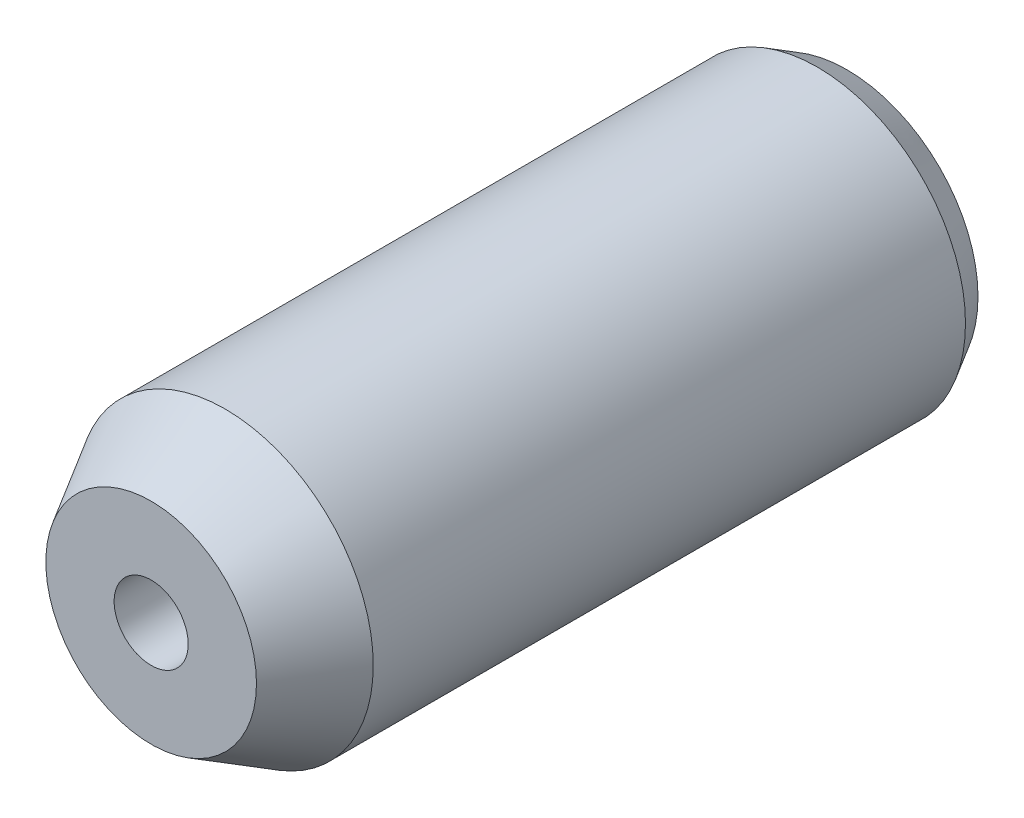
ISO-10303-21;
HEADER;
FILE_DESCRIPTION(('STEP AP214'),'2;1');
FILE_NAME('part.step','',(''),(''),'','','');
FILE_SCHEMA(('AUTOMOTIVE_DESIGN { 1 0 10303 214 1 1 1 1 }'));
ENDSEC;
DATA;
#1=APPLICATION_CONTEXT('core data for automotive mechanical design processes');
#2=APPLICATION_PROTOCOL_DEFINITION('international standard','automotive_design',2000,#1);
#3=PRODUCT_CONTEXT('',#1,'mechanical');
#4=PRODUCT('Part','Part','',(#3));
#5=PRODUCT_RELATED_PRODUCT_CATEGORY('part','',(#4));
#6=PRODUCT_DEFINITION_FORMATION('','',#4);
#7=PRODUCT_DEFINITION_CONTEXT('part definition',#1,'design');
#8=PRODUCT_DEFINITION('design','',#6,#7);
#9=PRODUCT_DEFINITION_SHAPE('','',#8);
#10=(LENGTH_UNIT() NAMED_UNIT(*) SI_UNIT(.MILLI.,.METRE.));
#11=(NAMED_UNIT(*) PLANE_ANGLE_UNIT() SI_UNIT($,.RADIAN.));
#12=(NAMED_UNIT(*) SI_UNIT($,.STERADIAN.) SOLID_ANGLE_UNIT());
#13=UNCERTAINTY_MEASURE_WITH_UNIT(LENGTH_MEASURE(1.E-05),#10,'distance_accuracy_value','');
#14=(GEOMETRIC_REPRESENTATION_CONTEXT(3) GLOBAL_UNCERTAINTY_ASSIGNED_CONTEXT((#13)) GLOBAL_UNIT_ASSIGNED_CONTEXT((#10,
#11,#12)) REPRESENTATION_CONTEXT('',''));
#15=CARTESIAN_POINT('',(0.,0.,0.));
#16=DIRECTION('',(0.,0.,1.));
#17=DIRECTION('',(1.,0.,0.));
#18=AXIS2_PLACEMENT_3D('',#15,#16,#17);
#19=CARTESIAN_POINT('',(0.,0.,0.));
#20=DIRECTION('',(0.,0.,1.));
#21=DIRECTION('',(1.,0.,0.));
#22=AXIS2_PLACEMENT_3D('',#19,#20,#21);
#23=PLANE('',#22);
#24=CARTESIAN_POINT('',(0.,0.,0.));
#25=DIRECTION('',(0.,0.,1.));
#26=DIRECTION('',(1.,0.,0.));
#27=AXIS2_PLACEMENT_3D('',#24,#25,#26);
#28=CIRCLE('',#27,8.84529946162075);
#29=CARTESIAN_POINT('',(8.84529946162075,0.,0.));
#30=VERTEX_POINT('',#29);
#31=EDGE_CURVE('E8',#30,#30,#28,.T.);
#32=ORIENTED_EDGE('',*,*,#31,.F.);
#33=EDGE_LOOP('',(#32));
#34=FACE_BOUND('',#33,.T.);
#35=ADVANCED_FACE('F12',(#34),#23,.F.);
#36=CARTESIAN_POINT('',(0.,0.,2.));
#37=DIRECTION('',(0.,0.,1.));
#38=DIRECTION('',(1.,0.,0.));
#39=AXIS2_PLACEMENT_3D('',#36,#37,#38);
#40=CONICAL_SURFACE('',#39,10.,0.523598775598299);
#41=ORIENTED_EDGE('',*,*,#31,.T.);
#42=EDGE_LOOP('',(#41));
#43=FACE_BOUND('',#42,.T.);
#44=CARTESIAN_POINT('',(0.,0.,2.));
#45=DIRECTION('',(0.,0.,1.));
#46=DIRECTION('',(1.,0.,0.));
#47=AXIS2_PLACEMENT_3D('',#44,#45,#46);
#48=CIRCLE('',#47,10.);
#49=CARTESIAN_POINT('',(10.,0.,2.));
#50=VERTEX_POINT('',#49);
#51=EDGE_CURVE('E18',#50,#50,#48,.T.);
#52=ORIENTED_EDGE('',*,*,#51,.F.);
#53=EDGE_LOOP('',(#52));
#54=FACE_BOUND('',#53,.T.);
#55=ADVANCED_FACE('F60',(#43,#54),#40,.T.);
#56=CARTESIAN_POINT('',(0.,0.,50.));
#57=DIRECTION('',(0.,0.,1.));
#58=DIRECTION('',(1.,0.,0.));
#59=AXIS2_PLACEMENT_3D('',#56,#57,#58);
#60=CYLINDRICAL_SURFACE('',#59,10.);
#61=CARTESIAN_POINT('',(0.,0.,42.));
#62=DIRECTION('',(0.,0.,1.));
#63=DIRECTION('',(1.,0.,0.));
#64=AXIS2_PLACEMENT_3D('',#61,#62,#63);
#65=CIRCLE('',#64,10.);
#66=CARTESIAN_POINT('',(10.,0.,42.));
#67=VERTEX_POINT('',#66);
#68=EDGE_CURVE('E22',#67,#67,#65,.T.);
#69=ORIENTED_EDGE('',*,*,#68,.F.);
#70=EDGE_LOOP('',(#69));
#71=FACE_BOUND('',#70,.T.);
#72=ORIENTED_EDGE('',*,*,#51,.T.);
#73=EDGE_LOOP('',(#72));
#74=FACE_BOUND('',#73,.T.);
#75=ADVANCED_FACE('F55',(#71,#74),#60,.T.);
#76=CARTESIAN_POINT('',(0.,0.,42.));
#77=DIRECTION('',(0.,0.,-1.));
#78=DIRECTION('',(-1.,0.,0.));
#79=AXIS2_PLACEMENT_3D('',#76,#77,#78);
#80=CONICAL_SURFACE('',#79,10.,0.523598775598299);
#81=CARTESIAN_POINT('',(0.,0.,47.));
#82=DIRECTION('',(0.,0.,1.));
#83=DIRECTION('',(1.,0.,0.));
#84=AXIS2_PLACEMENT_3D('',#81,#82,#83);
#85=CIRCLE('',#84,7.11324865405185);
#86=CARTESIAN_POINT('',(7.11324865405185,0.,47.));
#87=VERTEX_POINT('',#86);
#88=EDGE_CURVE('E26',#87,#87,#85,.T.);
#89=ORIENTED_EDGE('',*,*,#88,.F.);
#90=EDGE_LOOP('',(#89));
#91=FACE_BOUND('',#90,.T.);
#92=ORIENTED_EDGE('',*,*,#68,.T.);
#93=EDGE_LOOP('',(#92));
#94=FACE_BOUND('',#93,.T.);
#95=ADVANCED_FACE('F49',(#91,#94),#80,.T.);
#96=CARTESIAN_POINT('',(7.11324865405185,0.,47.));
#97=DIRECTION('',(0.,0.,-1.));
#98=DIRECTION('',(-1.,0.,0.));
#99=AXIS2_PLACEMENT_3D('',#96,#97,#98);
#100=PLANE('',#99);
#101=CARTESIAN_POINT('',(0.,0.,47.));
#102=DIRECTION('',(0.,0.,1.));
#103=DIRECTION('',(1.,0.,0.));
#104=AXIS2_PLACEMENT_3D('',#101,#102,#103);
#105=CIRCLE('',#104,2.5);
#106=CARTESIAN_POINT('',(2.5,0.,47.));
#107=VERTEX_POINT('',#106);
#108=EDGE_CURVE('E31',#107,#107,#105,.T.);
#109=ORIENTED_EDGE('',*,*,#108,.F.);
#110=EDGE_LOOP('',(#109));
#111=FACE_BOUND('',#110,.T.);
#112=ORIENTED_EDGE('',*,*,#88,.T.);
#113=EDGE_LOOP('',(#112));
#114=FACE_BOUND('',#113,.T.);
#115=ADVANCED_FACE('F43',(#111,#114),#100,.F.);
#116=CARTESIAN_POINT('',(0.,0.,50.));
#117=DIRECTION('',(0.,0.,1.));
#118=DIRECTION('',(1.,0.,0.));
#119=AXIS2_PLACEMENT_3D('',#116,#117,#118);
#120=CYLINDRICAL_SURFACE('',#119,2.5);
#121=CARTESIAN_POINT('',(0.,0.,37.));
#122=DIRECTION('',(0.,0.,1.));
#123=DIRECTION('',(1.,0.,0.));
#124=AXIS2_PLACEMENT_3D('',#121,#122,#123);
#125=CIRCLE('',#124,2.5);
#126=CARTESIAN_POINT('',(2.5,0.,37.));
#127=VERTEX_POINT('',#126);
#128=EDGE_CURVE('E34',#127,#127,#125,.T.);
#129=ORIENTED_EDGE('',*,*,#128,.F.);
#130=EDGE_LOOP('',(#129));
#131=FACE_BOUND('',#130,.T.);
#132=ORIENTED_EDGE('',*,*,#108,.T.);
#133=EDGE_LOOP('',(#132));
#134=FACE_BOUND('',#133,.T.);
#135=ADVANCED_FACE('F40',(#131,#134),#120,.F.);
#136=CARTESIAN_POINT('',(0.,0.,37.));
#137=DIRECTION('',(0.,0.,1.));
#138=DIRECTION('',(1.,0.,0.));
#139=AXIS2_PLACEMENT_3D('',#136,#137,#138);
#140=PLANE('',#139);
#141=ORIENTED_EDGE('',*,*,#128,.T.);
#142=EDGE_LOOP('',(#141));
#143=FACE_BOUND('',#142,.T.);
#144=ADVANCED_FACE('F38',(#143),#140,.T.);
#145=CLOSED_SHELL('',(#35,#55,#75,#95,#115,#135,#144));
#146=MANIFOLD_SOLID_BREP('B1',#145);
#147=ADVANCED_BREP_SHAPE_REPRESENTATION('',(#18,#146),#14);
#148=SHAPE_DEFINITION_REPRESENTATION(#9,#147);
ENDSEC;
END-ISO-10303-21;
